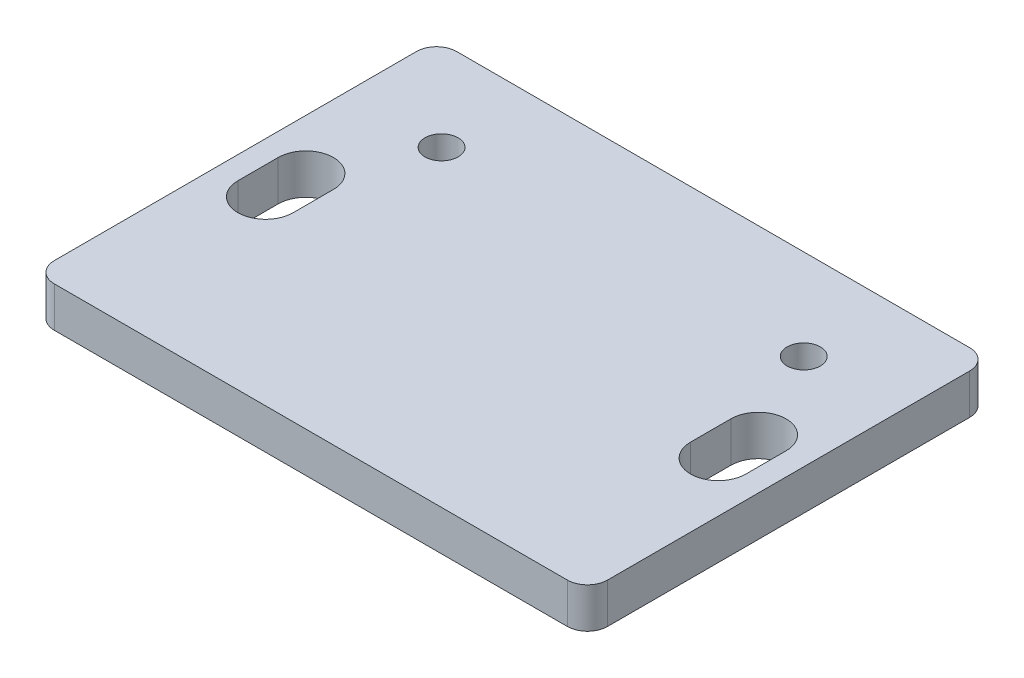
ISO-10303-21;
HEADER;
FILE_DESCRIPTION(('STEP AP214'),'2;1');
FILE_NAME('part.step','',(''),(''),'','','');
FILE_SCHEMA(('AUTOMOTIVE_DESIGN { 1 0 10303 214 1 1 1 1 }'));
ENDSEC;
DATA;
#1=APPLICATION_CONTEXT('core data for automotive mechanical design processes');
#2=APPLICATION_PROTOCOL_DEFINITION('international standard','automotive_design',2000,#1);
#3=PRODUCT_CONTEXT('',#1,'mechanical');
#4=PRODUCT('Part','Part','',(#3));
#5=PRODUCT_RELATED_PRODUCT_CATEGORY('part','',(#4));
#6=PRODUCT_DEFINITION_FORMATION('','',#4);
#7=PRODUCT_DEFINITION_CONTEXT('part definition',#1,'design');
#8=PRODUCT_DEFINITION('design','',#6,#7);
#9=PRODUCT_DEFINITION_SHAPE('','',#8);
#10=(LENGTH_UNIT() NAMED_UNIT(*) SI_UNIT(.MILLI.,.METRE.));
#11=(NAMED_UNIT(*) PLANE_ANGLE_UNIT() SI_UNIT($,.RADIAN.));
#12=(NAMED_UNIT(*) SI_UNIT($,.STERADIAN.) SOLID_ANGLE_UNIT());
#13=UNCERTAINTY_MEASURE_WITH_UNIT(LENGTH_MEASURE(1.E-05),#10,'distance_accuracy_value','');
#14=(GEOMETRIC_REPRESENTATION_CONTEXT(3) GLOBAL_UNCERTAINTY_ASSIGNED_CONTEXT((#13)) GLOBAL_UNIT_ASSIGNED_CONTEXT((#10,
#11,#12)) REPRESENTATION_CONTEXT('',''));
#15=CARTESIAN_POINT('',(0.,0.,0.));
#16=DIRECTION('',(0.,0.,1.));
#17=DIRECTION('',(1.,0.,0.));
#18=AXIS2_PLACEMENT_3D('',#15,#16,#17);
#19=CARTESIAN_POINT('',(27.5,4.,20.));
#20=DIRECTION('',(-1.,0.,0.));
#21=DIRECTION('',(0.,0.,1.));
#22=AXIS2_PLACEMENT_3D('',#19,#20,#21);
#23=PLANE('',#22);
#24=DIRECTION('',(0.,0.,-1.));
#25=VECTOR('',#24,1.);
#26=CARTESIAN_POINT('',(27.5,0.,20.));
#27=LINE('',#26,#25);
#28=CARTESIAN_POINT('',(27.5,0.,18.));
#29=VERTEX_POINT('',#28);
#30=CARTESIAN_POINT('',(27.5,0.,-18.));
#31=VERTEX_POINT('',#30);
#32=EDGE_CURVE('E238',#29,#31,#27,.T.);
#33=ORIENTED_EDGE('',*,*,#32,.T.);
#34=DIRECTION('',(0.,-1.,0.));
#35=VECTOR('',#34,1.);
#36=CARTESIAN_POINT('',(27.5,4.,-18.));
#37=LINE('',#36,#35);
#38=CARTESIAN_POINT('',(27.5,4.,-18.));
#39=VERTEX_POINT('',#38);
#40=EDGE_CURVE('E11',#31,#39,#37,.F.);
#41=ORIENTED_EDGE('',*,*,#40,.T.);
#42=DIRECTION('',(0.,0.,-1.));
#43=VECTOR('',#42,1.);
#44=CARTESIAN_POINT('',(27.5,4.,20.));
#45=LINE('',#44,#43);
#46=CARTESIAN_POINT('',(27.5,4.,18.));
#47=VERTEX_POINT('',#46);
#48=EDGE_CURVE('E239',#47,#39,#45,.T.);
#49=ORIENTED_EDGE('',*,*,#48,.F.);
#50=DIRECTION('',(0.,-1.,0.));
#51=VECTOR('',#50,1.);
#52=CARTESIAN_POINT('',(27.5,4.,18.));
#53=LINE('',#52,#51);
#54=EDGE_CURVE('E45',#47,#29,#53,.T.);
#55=ORIENTED_EDGE('',*,*,#54,.T.);
#56=EDGE_LOOP('',(#33,#41,#49,#55));
#57=FACE_BOUND('',#56,.T.);
#58=ADVANCED_FACE('F37',(#57),#23,.F.);
#59=CARTESIAN_POINT('',(-27.5,4.,-20.));
#60=DIRECTION('',(0.,0.,1.));
#61=DIRECTION('',(1.,0.,0.));
#62=AXIS2_PLACEMENT_3D('',#59,#60,#61);
#63=PLANE('',#62);
#64=DIRECTION('',(-1.,0.,0.));
#65=VECTOR('',#64,1.);
#66=CARTESIAN_POINT('',(-27.5,0.,-20.));
#67=LINE('',#66,#65);
#68=CARTESIAN_POINT('',(25.5,0.,-20.));
#69=VERTEX_POINT('',#68);
#70=CARTESIAN_POINT('',(-25.5,0.,-20.));
#71=VERTEX_POINT('',#70);
#72=EDGE_CURVE('E253',#69,#71,#67,.T.);
#73=ORIENTED_EDGE('',*,*,#72,.T.);
#74=DIRECTION('',(0.,-1.,0.));
#75=VECTOR('',#74,1.);
#76=CARTESIAN_POINT('',(-25.5,4.,-20.));
#77=LINE('',#76,#75);
#78=CARTESIAN_POINT('',(-25.5,4.,-20.));
#79=VERTEX_POINT('',#78);
#80=EDGE_CURVE('E52',#71,#79,#77,.F.);
#81=ORIENTED_EDGE('',*,*,#80,.T.);
#82=DIRECTION('',(-1.,0.,0.));
#83=VECTOR('',#82,1.);
#84=CARTESIAN_POINT('',(-27.5,4.,-20.));
#85=LINE('',#84,#83);
#86=CARTESIAN_POINT('',(25.5,4.,-20.));
#87=VERTEX_POINT('',#86);
#88=EDGE_CURVE('E241',#87,#79,#85,.T.);
#89=ORIENTED_EDGE('',*,*,#88,.F.);
#90=DIRECTION('',(0.,-1.,0.));
#91=VECTOR('',#90,1.);
#92=CARTESIAN_POINT('',(25.5,4.,-20.));
#93=LINE('',#92,#91);
#94=EDGE_CURVE('E284',#87,#69,#93,.T.);
#95=ORIENTED_EDGE('',*,*,#94,.T.);
#96=EDGE_LOOP('',(#73,#81,#89,#95));
#97=FACE_BOUND('',#96,.T.);
#98=ADVANCED_FACE('F301',(#97),#63,.F.);
#99=CARTESIAN_POINT('',(-27.5,4.,20.));
#100=DIRECTION('',(1.,0.,0.));
#101=DIRECTION('',(0.,0.,-1.));
#102=AXIS2_PLACEMENT_3D('',#99,#100,#101);
#103=PLANE('',#102);
#104=DIRECTION('',(0.,0.,1.));
#105=VECTOR('',#104,1.);
#106=CARTESIAN_POINT('',(-27.5,0.,20.));
#107=LINE('',#106,#105);
#108=CARTESIAN_POINT('',(-27.5,0.,-18.));
#109=VERTEX_POINT('',#108);
#110=CARTESIAN_POINT('',(-27.5,0.,18.));
#111=VERTEX_POINT('',#110);
#112=EDGE_CURVE('E255',#109,#111,#107,.T.);
#113=ORIENTED_EDGE('',*,*,#112,.T.);
#114=DIRECTION('',(0.,-1.,0.));
#115=VECTOR('',#114,1.);
#116=CARTESIAN_POINT('',(-27.5,4.,18.));
#117=LINE('',#116,#115);
#118=CARTESIAN_POINT('',(-27.5,4.,18.));
#119=VERTEX_POINT('',#118);
#120=EDGE_CURVE('E275',#111,#119,#117,.F.);
#121=ORIENTED_EDGE('',*,*,#120,.T.);
#122=DIRECTION('',(0.,0.,1.));
#123=VECTOR('',#122,1.);
#124=CARTESIAN_POINT('',(-27.5,4.,20.));
#125=LINE('',#124,#123);
#126=CARTESIAN_POINT('',(-27.5,4.,-18.));
#127=VERTEX_POINT('',#126);
#128=EDGE_CURVE('E244',#127,#119,#125,.T.);
#129=ORIENTED_EDGE('',*,*,#128,.F.);
#130=DIRECTION('',(0.,-1.,0.));
#131=VECTOR('',#130,1.);
#132=CARTESIAN_POINT('',(-27.5,4.,-18.));
#133=LINE('',#132,#131);
#134=EDGE_CURVE('E272',#127,#109,#133,.T.);
#135=ORIENTED_EDGE('',*,*,#134,.T.);
#136=EDGE_LOOP('',(#113,#121,#129,#135));
#137=FACE_BOUND('',#136,.T.);
#138=ADVANCED_FACE('F310',(#137),#103,.F.);
#139=CARTESIAN_POINT('',(-27.5,4.,20.));
#140=DIRECTION('',(0.,0.,-1.));
#141=DIRECTION('',(-1.,0.,0.));
#142=AXIS2_PLACEMENT_3D('',#139,#140,#141);
#143=PLANE('',#142);
#144=DIRECTION('',(1.,0.,0.));
#145=VECTOR('',#144,1.);
#146=CARTESIAN_POINT('',(-27.5,4.,20.));
#147=LINE('',#146,#145);
#148=CARTESIAN_POINT('',(-25.5,4.,20.));
#149=VERTEX_POINT('',#148);
#150=CARTESIAN_POINT('',(25.5,4.,20.));
#151=VERTEX_POINT('',#150);
#152=EDGE_CURVE('E247',#149,#151,#147,.T.);
#153=ORIENTED_EDGE('',*,*,#152,.F.);
#154=DIRECTION('',(0.,-1.,0.));
#155=VECTOR('',#154,1.);
#156=CARTESIAN_POINT('',(-25.5,4.,20.));
#157=LINE('',#156,#155);
#158=CARTESIAN_POINT('',(-25.5,0.,20.));
#159=VERTEX_POINT('',#158);
#160=EDGE_CURVE('E261',#149,#159,#157,.T.);
#161=ORIENTED_EDGE('',*,*,#160,.T.);
#162=DIRECTION('',(1.,0.,0.));
#163=VECTOR('',#162,1.);
#164=CARTESIAN_POINT('',(-27.5,0.,20.));
#165=LINE('',#164,#163);
#166=CARTESIAN_POINT('',(25.5,0.,20.));
#167=VERTEX_POINT('',#166);
#168=EDGE_CURVE('E242',#159,#167,#165,.T.);
#169=ORIENTED_EDGE('',*,*,#168,.T.);
#170=DIRECTION('',(0.,-1.,0.));
#171=VECTOR('',#170,1.);
#172=CARTESIAN_POINT('',(25.5,4.,20.));
#173=LINE('',#172,#171);
#174=EDGE_CURVE('E250',#167,#151,#173,.F.);
#175=ORIENTED_EDGE('',*,*,#174,.T.);
#176=EDGE_LOOP('',(#153,#161,#169,#175));
#177=FACE_BOUND('',#176,.T.);
#178=ADVANCED_FACE('F318',(#177),#143,.F.);
#179=CARTESIAN_POINT('',(0.,4.,0.));
#180=DIRECTION('',(0.,-1.,0.));
#181=DIRECTION('',(0.,0.,-1.));
#182=AXIS2_PLACEMENT_3D('',#179,#180,#181);
#183=PLANE('',#182);
#184=DIRECTION('',(0.,0.,-1.));
#185=VECTOR('',#184,1.);
#186=CARTESIAN_POINT('',(25.25,4.,2.));
#187=LINE('',#186,#185);
#188=CARTESIAN_POINT('',(25.25,4.,2.));
#189=VERTEX_POINT('',#188);
#190=CARTESIAN_POINT('',(25.25,4.,-2.));
#191=VERTEX_POINT('',#190);
#192=EDGE_CURVE('E185',#189,#191,#187,.T.);
#193=ORIENTED_EDGE('',*,*,#192,.F.);
#194=CARTESIAN_POINT('',(22.5,4.,2.));
#195=DIRECTION('',(0.,1.,0.));
#196=DIRECTION('',(0.,0.,1.));
#197=AXIS2_PLACEMENT_3D('',#194,#195,#196);
#198=CIRCLE('',#197,2.75);
#199=CARTESIAN_POINT('',(19.75,4.,2.));
#200=VERTEX_POINT('',#199);
#201=EDGE_CURVE('E158',#200,#189,#198,.T.);
#202=ORIENTED_EDGE('',*,*,#201,.F.);
#203=DIRECTION('',(0.,0.,1.));
#204=VECTOR('',#203,1.);
#205=CARTESIAN_POINT('',(19.75,4.,2.));
#206=LINE('',#205,#204);
#207=CARTESIAN_POINT('',(19.75,4.,-2.));
#208=VERTEX_POINT('',#207);
#209=EDGE_CURVE('E176',#208,#200,#206,.T.);
#210=ORIENTED_EDGE('',*,*,#209,.F.);
#211=CARTESIAN_POINT('',(22.5,4.,-2.));
#212=DIRECTION('',(0.,1.,0.));
#213=DIRECTION('',(0.,0.,1.));
#214=AXIS2_PLACEMENT_3D('',#211,#212,#213);
#215=CIRCLE('',#214,2.75);
#216=EDGE_CURVE('E179',#191,#208,#215,.T.);
#217=ORIENTED_EDGE('',*,*,#216,.F.);
#218=EDGE_LOOP('',(#193,#202,#210,#217));
#219=FACE_BOUND('',#218,.T.);
#220=DIRECTION('',(0.,0.,-1.));
#221=VECTOR('',#220,1.);
#222=CARTESIAN_POINT('',(-19.75,4.,2.00000000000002));
#223=LINE('',#222,#221);
#224=CARTESIAN_POINT('',(-19.75,4.,2.00000000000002));
#225=VERTEX_POINT('',#224);
#226=CARTESIAN_POINT('',(-19.75,4.,-1.99999999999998));
#227=VERTEX_POINT('',#226);
#228=EDGE_CURVE('E210',#225,#227,#223,.T.);
#229=ORIENTED_EDGE('',*,*,#228,.F.);
#230=CARTESIAN_POINT('',(-22.5,4.,2.00000000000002));
#231=DIRECTION('',(0.,1.,0.));
#232=DIRECTION('',(0.,0.,1.));
#233=AXIS2_PLACEMENT_3D('',#230,#231,#232);
#234=CIRCLE('',#233,2.75);
#235=CARTESIAN_POINT('',(-25.25,4.,2.00000000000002));
#236=VERTEX_POINT('',#235);
#237=EDGE_CURVE('E191',#236,#225,#234,.T.);
#238=ORIENTED_EDGE('',*,*,#237,.F.);
#239=DIRECTION('',(0.,0.,1.));
#240=VECTOR('',#239,1.);
#241=CARTESIAN_POINT('',(-25.25,4.,2.00000000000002));
#242=LINE('',#241,#240);
#243=CARTESIAN_POINT('',(-25.25,4.,-1.99999999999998));
#244=VERTEX_POINT('',#243);
#245=EDGE_CURVE('E199',#244,#236,#242,.T.);
#246=ORIENTED_EDGE('',*,*,#245,.F.);
#247=CARTESIAN_POINT('',(-22.5,4.,-1.99999999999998));
#248=DIRECTION('',(0.,1.,0.));
#249=DIRECTION('',(0.,0.,1.));
#250=AXIS2_PLACEMENT_3D('',#247,#248,#249);
#251=CIRCLE('',#250,2.75);
#252=EDGE_CURVE('E213',#227,#244,#251,.T.);
#253=ORIENTED_EDGE('',*,*,#252,.F.);
#254=EDGE_LOOP('',(#229,#238,#246,#253));
#255=FACE_BOUND('',#254,.T.);
#256=CARTESIAN_POINT('',(-18.,4.,-11.));
#257=DIRECTION('',(0.,1.,0.));
#258=DIRECTION('',(0.,0.,1.));
#259=AXIS2_PLACEMENT_3D('',#256,#257,#258);
#260=CIRCLE('',#259,1.65);
#261=CARTESIAN_POINT('',(-18.,4.,-9.35));
#262=VERTEX_POINT('',#261);
#263=EDGE_CURVE('E220',#262,#262,#260,.T.);
#264=ORIENTED_EDGE('',*,*,#263,.F.);
#265=EDGE_LOOP('',(#264));
#266=FACE_BOUND('',#265,.T.);
#267=CARTESIAN_POINT('',(18.,4.,-11.));
#268=DIRECTION('',(0.,1.,0.));
#269=DIRECTION('',(0.,0.,1.));
#270=AXIS2_PLACEMENT_3D('',#267,#268,#269);
#271=CIRCLE('',#270,1.65);
#272=CARTESIAN_POINT('',(18.,4.,-9.35));
#273=VERTEX_POINT('',#272);
#274=EDGE_CURVE('E232',#273,#273,#271,.T.);
#275=ORIENTED_EDGE('',*,*,#274,.F.);
#276=EDGE_LOOP('',(#275));
#277=FACE_BOUND('',#276,.T.);
#278=ORIENTED_EDGE('',*,*,#128,.T.);
#279=CARTESIAN_POINT('',(-25.5,4.,18.));
#280=DIRECTION('',(0.,-1.,0.));
#281=DIRECTION('',(0.,0.,-1.));
#282=AXIS2_PLACEMENT_3D('',#279,#280,#281);
#283=CIRCLE('',#282,2.);
#284=EDGE_CURVE('E282',#119,#149,#283,.F.);
#285=ORIENTED_EDGE('',*,*,#284,.T.);
#286=ORIENTED_EDGE('',*,*,#152,.T.);
#287=CARTESIAN_POINT('',(25.5,4.,18.));
#288=DIRECTION('',(0.,-1.,0.));
#289=DIRECTION('',(0.,0.,-1.));
#290=AXIS2_PLACEMENT_3D('',#287,#288,#289);
#291=CIRCLE('',#290,2.);
#292=EDGE_CURVE('E277',#151,#47,#291,.F.);
#293=ORIENTED_EDGE('',*,*,#292,.T.);
#294=ORIENTED_EDGE('',*,*,#48,.T.);
#295=CARTESIAN_POINT('',(25.5,4.,-18.));
#296=DIRECTION('',(0.,-1.,0.));
#297=DIRECTION('',(0.,0.,-1.));
#298=AXIS2_PLACEMENT_3D('',#295,#296,#297);
#299=CIRCLE('',#298,2.);
#300=EDGE_CURVE('E59',#39,#87,#299,.F.);
#301=ORIENTED_EDGE('',*,*,#300,.T.);
#302=ORIENTED_EDGE('',*,*,#88,.T.);
#303=CARTESIAN_POINT('',(-25.5,4.,-18.));
#304=DIRECTION('',(0.,-1.,0.));
#305=DIRECTION('',(0.,0.,-1.));
#306=AXIS2_PLACEMENT_3D('',#303,#304,#305);
#307=CIRCLE('',#306,2.);
#308=EDGE_CURVE('E280',#79,#127,#307,.F.);
#309=ORIENTED_EDGE('',*,*,#308,.T.);
#310=EDGE_LOOP('',(#278,#285,#286,#293,#294,#301,#302,#309));
#311=FACE_BOUND('',#310,.T.);
#312=ADVANCED_FACE('F303',(#219,#255,#266,#277,#311),#183,.F.);
#313=CARTESIAN_POINT('',(0.,0.,0.));
#314=DIRECTION('',(0.,-1.,0.));
#315=DIRECTION('',(0.,0.,-1.));
#316=AXIS2_PLACEMENT_3D('',#313,#314,#315);
#317=PLANE('',#316);
#318=CARTESIAN_POINT('',(22.5,0.,2.));
#319=DIRECTION('',(0.,1.,0.));
#320=DIRECTION('',(0.,0.,1.));
#321=AXIS2_PLACEMENT_3D('',#318,#319,#320);
#322=CIRCLE('',#321,2.75);
#323=CARTESIAN_POINT('',(19.75,0.,2.));
#324=VERTEX_POINT('',#323);
#325=CARTESIAN_POINT('',(25.25,0.,2.));
#326=VERTEX_POINT('',#325);
#327=EDGE_CURVE('E155',#324,#326,#322,.T.);
#328=ORIENTED_EDGE('',*,*,#327,.T.);
#329=DIRECTION('',(0.,0.,-1.));
#330=VECTOR('',#329,1.);
#331=CARTESIAN_POINT('',(25.25,0.,2.));
#332=LINE('',#331,#330);
#333=CARTESIAN_POINT('',(25.25,0.,-2.));
#334=VERTEX_POINT('',#333);
#335=EDGE_CURVE('E167',#326,#334,#332,.T.);
#336=ORIENTED_EDGE('',*,*,#335,.T.);
#337=CARTESIAN_POINT('',(22.5,0.,-2.));
#338=DIRECTION('',(0.,1.,0.));
#339=DIRECTION('',(0.,0.,1.));
#340=AXIS2_PLACEMENT_3D('',#337,#338,#339);
#341=CIRCLE('',#340,2.75);
#342=CARTESIAN_POINT('',(19.75,0.,-2.));
#343=VERTEX_POINT('',#342);
#344=EDGE_CURVE('E171',#334,#343,#341,.T.);
#345=ORIENTED_EDGE('',*,*,#344,.T.);
#346=DIRECTION('',(0.,0.,1.));
#347=VECTOR('',#346,1.);
#348=CARTESIAN_POINT('',(19.75,0.,2.));
#349=LINE('',#348,#347);
#350=EDGE_CURVE('E163',#343,#324,#349,.T.);
#351=ORIENTED_EDGE('',*,*,#350,.T.);
#352=EDGE_LOOP('',(#328,#336,#345,#351));
#353=FACE_BOUND('',#352,.T.);
#354=CARTESIAN_POINT('',(-22.5,0.,2.00000000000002));
#355=DIRECTION('',(0.,1.,0.));
#356=DIRECTION('',(0.,0.,1.));
#357=AXIS2_PLACEMENT_3D('',#354,#355,#356);
#358=CIRCLE('',#357,2.75);
#359=CARTESIAN_POINT('',(-25.25,0.,2.00000000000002));
#360=VERTEX_POINT('',#359);
#361=CARTESIAN_POINT('',(-19.75,0.,2.00000000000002));
#362=VERTEX_POINT('',#361);
#363=EDGE_CURVE('E195',#360,#362,#358,.T.);
#364=ORIENTED_EDGE('',*,*,#363,.T.);
#365=DIRECTION('',(0.,0.,-1.));
#366=VECTOR('',#365,1.);
#367=CARTESIAN_POINT('',(-19.75,0.,2.00000000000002));
#368=LINE('',#367,#366);
#369=CARTESIAN_POINT('',(-19.75,0.,-1.99999999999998));
#370=VERTEX_POINT('',#369);
#371=EDGE_CURVE('E198',#362,#370,#368,.T.);
#372=ORIENTED_EDGE('',*,*,#371,.T.);
#373=CARTESIAN_POINT('',(-22.5,0.,-1.99999999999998));
#374=DIRECTION('',(0.,1.,0.));
#375=DIRECTION('',(0.,0.,1.));
#376=AXIS2_PLACEMENT_3D('',#373,#374,#375);
#377=CIRCLE('',#376,2.75);
#378=CARTESIAN_POINT('',(-25.25,0.,-1.99999999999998));
#379=VERTEX_POINT('',#378);
#380=EDGE_CURVE('E202',#370,#379,#377,.T.);
#381=ORIENTED_EDGE('',*,*,#380,.T.);
#382=DIRECTION('',(0.,0.,1.));
#383=VECTOR('',#382,1.);
#384=CARTESIAN_POINT('',(-25.25,0.,2.00000000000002));
#385=LINE('',#384,#383);
#386=EDGE_CURVE('E205',#379,#360,#385,.T.);
#387=ORIENTED_EDGE('',*,*,#386,.T.);
#388=EDGE_LOOP('',(#364,#372,#381,#387));
#389=FACE_BOUND('',#388,.T.);
#390=CARTESIAN_POINT('',(-18.,0.,-11.));
#391=DIRECTION('',(0.,1.,0.));
#392=DIRECTION('',(0.,0.,1.));
#393=AXIS2_PLACEMENT_3D('',#390,#391,#392);
#394=CIRCLE('',#393,1.65);
#395=CARTESIAN_POINT('',(-18.,0.,-9.35));
#396=VERTEX_POINT('',#395);
#397=EDGE_CURVE('E229',#396,#396,#394,.T.);
#398=ORIENTED_EDGE('',*,*,#397,.T.);
#399=EDGE_LOOP('',(#398));
#400=FACE_BOUND('',#399,.T.);
#401=CARTESIAN_POINT('',(18.,0.,-11.));
#402=DIRECTION('',(0.,1.,0.));
#403=DIRECTION('',(0.,0.,1.));
#404=AXIS2_PLACEMENT_3D('',#401,#402,#403);
#405=CIRCLE('',#404,1.65);
#406=CARTESIAN_POINT('',(18.,0.,-9.35));
#407=VERTEX_POINT('',#406);
#408=EDGE_CURVE('E235',#407,#407,#405,.T.);
#409=ORIENTED_EDGE('',*,*,#408,.T.);
#410=EDGE_LOOP('',(#409));
#411=FACE_BOUND('',#410,.T.);
#412=ORIENTED_EDGE('',*,*,#168,.F.);
#413=CARTESIAN_POINT('',(-25.5,0.,18.));
#414=DIRECTION('',(0.,-1.,0.));
#415=DIRECTION('',(0.,0.,-1.));
#416=AXIS2_PLACEMENT_3D('',#413,#414,#415);
#417=CIRCLE('',#416,2.);
#418=EDGE_CURVE('E270',#159,#111,#417,.T.);
#419=ORIENTED_EDGE('',*,*,#418,.T.);
#420=ORIENTED_EDGE('',*,*,#112,.F.);
#421=CARTESIAN_POINT('',(-25.5,0.,-18.));
#422=DIRECTION('',(0.,-1.,0.));
#423=DIRECTION('',(0.,0.,-1.));
#424=AXIS2_PLACEMENT_3D('',#421,#422,#423);
#425=CIRCLE('',#424,2.);
#426=EDGE_CURVE('E268',#109,#71,#425,.T.);
#427=ORIENTED_EDGE('',*,*,#426,.T.);
#428=ORIENTED_EDGE('',*,*,#72,.F.);
#429=CARTESIAN_POINT('',(25.5,0.,-18.));
#430=DIRECTION('',(0.,-1.,0.));
#431=DIRECTION('',(0.,0.,-1.));
#432=AXIS2_PLACEMENT_3D('',#429,#430,#431);
#433=CIRCLE('',#432,2.);
#434=EDGE_CURVE('E266',#69,#31,#433,.T.);
#435=ORIENTED_EDGE('',*,*,#434,.T.);
#436=ORIENTED_EDGE('',*,*,#32,.F.);
#437=CARTESIAN_POINT('',(25.5,0.,18.));
#438=DIRECTION('',(0.,-1.,0.));
#439=DIRECTION('',(0.,0.,-1.));
#440=AXIS2_PLACEMENT_3D('',#437,#438,#439);
#441=CIRCLE('',#440,2.);
#442=EDGE_CURVE('E264',#29,#167,#441,.T.);
#443=ORIENTED_EDGE('',*,*,#442,.T.);
#444=EDGE_LOOP('',(#412,#419,#420,#427,#428,#435,#436,#443));
#445=FACE_BOUND('',#444,.T.);
#446=ADVANCED_FACE('F173',(#353,#389,#400,#411,#445),#317,.T.);
#447=CARTESIAN_POINT('',(18.,4.,-11.));
#448=DIRECTION('',(0.,1.,0.));
#449=DIRECTION('',(0.,0.,1.));
#450=AXIS2_PLACEMENT_3D('',#447,#448,#449);
#451=CYLINDRICAL_SURFACE('',#450,1.65);
#452=ORIENTED_EDGE('',*,*,#408,.F.);
#453=EDGE_LOOP('',(#452));
#454=FACE_BOUND('',#453,.T.);
#455=ORIENTED_EDGE('',*,*,#274,.T.);
#456=EDGE_LOOP('',(#455));
#457=FACE_BOUND('',#456,.T.);
#458=ADVANCED_FACE('F433',(#454,#457),#451,.F.);
#459=CARTESIAN_POINT('',(-18.,4.,-11.));
#460=DIRECTION('',(0.,1.,0.));
#461=DIRECTION('',(0.,0.,1.));
#462=AXIS2_PLACEMENT_3D('',#459,#460,#461);
#463=CYLINDRICAL_SURFACE('',#462,1.65);
#464=ORIENTED_EDGE('',*,*,#397,.F.);
#465=EDGE_LOOP('',(#464));
#466=FACE_BOUND('',#465,.T.);
#467=ORIENTED_EDGE('',*,*,#263,.T.);
#468=EDGE_LOOP('',(#467));
#469=FACE_BOUND('',#468,.T.);
#470=ADVANCED_FACE('F424',(#466,#469),#463,.F.);
#471=CARTESIAN_POINT('',(-22.5,0.,2.00000000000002));
#472=DIRECTION('',(0.,1.,0.));
#473=DIRECTION('',(0.,0.,1.));
#474=AXIS2_PLACEMENT_3D('',#471,#472,#473);
#475=CYLINDRICAL_SURFACE('',#474,2.75);
#476=ORIENTED_EDGE('',*,*,#237,.T.);
#477=DIRECTION('',(0.,1.,0.));
#478=VECTOR('',#477,1.);
#479=CARTESIAN_POINT('',(-19.75,0.,2.00000000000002));
#480=LINE('',#479,#478);
#481=EDGE_CURVE('E208',#362,#225,#480,.T.);
#482=ORIENTED_EDGE('',*,*,#481,.F.);
#483=ORIENTED_EDGE('',*,*,#363,.F.);
#484=DIRECTION('',(0.,1.,0.));
#485=VECTOR('',#484,1.);
#486=CARTESIAN_POINT('',(-25.25,0.,2.00000000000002));
#487=LINE('',#486,#485);
#488=EDGE_CURVE('E218',#360,#236,#487,.T.);
#489=ORIENTED_EDGE('',*,*,#488,.T.);
#490=EDGE_LOOP('',(#476,#482,#483,#489));
#491=FACE_BOUND('',#490,.T.);
#492=ADVANCED_FACE('F415',(#491),#475,.F.);
#493=CARTESIAN_POINT('',(-25.25,0.,2.00000000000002));
#494=DIRECTION('',(-1.,0.,0.));
#495=DIRECTION('',(0.,0.,1.));
#496=AXIS2_PLACEMENT_3D('',#493,#494,#495);
#497=PLANE('',#496);
#498=ORIENTED_EDGE('',*,*,#245,.T.);
#499=ORIENTED_EDGE('',*,*,#488,.F.);
#500=ORIENTED_EDGE('',*,*,#386,.F.);
#501=DIRECTION('',(0.,1.,0.));
#502=VECTOR('',#501,1.);
#503=CARTESIAN_POINT('',(-25.25,0.,-1.99999999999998));
#504=LINE('',#503,#502);
#505=EDGE_CURVE('E221',#379,#244,#504,.T.);
#506=ORIENTED_EDGE('',*,*,#505,.T.);
#507=EDGE_LOOP('',(#498,#499,#500,#506));
#508=FACE_BOUND('',#507,.T.);
#509=ADVANCED_FACE('F406',(#508),#497,.F.);
#510=CARTESIAN_POINT('',(-22.5,0.,-1.99999999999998));
#511=DIRECTION('',(0.,1.,0.));
#512=DIRECTION('',(0.,0.,1.));
#513=AXIS2_PLACEMENT_3D('',#510,#511,#512);
#514=CYLINDRICAL_SURFACE('',#513,2.75);
#515=ORIENTED_EDGE('',*,*,#252,.T.);
#516=ORIENTED_EDGE('',*,*,#505,.F.);
#517=ORIENTED_EDGE('',*,*,#380,.F.);
#518=DIRECTION('',(0.,1.,0.));
#519=VECTOR('',#518,1.);
#520=CARTESIAN_POINT('',(-19.75,0.,-1.99999999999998));
#521=LINE('',#520,#519);
#522=EDGE_CURVE('E223',#370,#227,#521,.T.);
#523=ORIENTED_EDGE('',*,*,#522,.T.);
#524=EDGE_LOOP('',(#515,#516,#517,#523));
#525=FACE_BOUND('',#524,.T.);
#526=ADVANCED_FACE('F397',(#525),#514,.F.);
#527=CARTESIAN_POINT('',(-19.75,0.,2.00000000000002));
#528=DIRECTION('',(1.,0.,0.));
#529=DIRECTION('',(0.,0.,-1.));
#530=AXIS2_PLACEMENT_3D('',#527,#528,#529);
#531=PLANE('',#530);
#532=ORIENTED_EDGE('',*,*,#228,.T.);
#533=ORIENTED_EDGE('',*,*,#522,.F.);
#534=ORIENTED_EDGE('',*,*,#371,.F.);
#535=ORIENTED_EDGE('',*,*,#481,.T.);
#536=EDGE_LOOP('',(#532,#533,#534,#535));
#537=FACE_BOUND('',#536,.T.);
#538=ADVANCED_FACE('F389',(#537),#531,.F.);
#539=CARTESIAN_POINT('',(22.5,0.,2.));
#540=DIRECTION('',(0.,1.,0.));
#541=DIRECTION('',(0.,0.,1.));
#542=AXIS2_PLACEMENT_3D('',#539,#540,#541);
#543=CYLINDRICAL_SURFACE('',#542,2.75);
#544=ORIENTED_EDGE('',*,*,#201,.T.);
#545=DIRECTION('',(0.,1.,0.));
#546=VECTOR('',#545,1.);
#547=CARTESIAN_POINT('',(25.25,0.,2.));
#548=LINE('',#547,#546);
#549=EDGE_CURVE('E151',#326,#189,#548,.T.);
#550=ORIENTED_EDGE('',*,*,#549,.F.);
#551=ORIENTED_EDGE('',*,*,#327,.F.);
#552=DIRECTION('',(0.,1.,0.));
#553=VECTOR('',#552,1.);
#554=CARTESIAN_POINT('',(19.75,0.,2.));
#555=LINE('',#554,#553);
#556=EDGE_CURVE('E189',#324,#200,#555,.T.);
#557=ORIENTED_EDGE('',*,*,#556,.T.);
#558=EDGE_LOOP('',(#544,#550,#551,#557));
#559=FACE_BOUND('',#558,.T.);
#560=ADVANCED_FACE('F153',(#559),#543,.F.);
#561=CARTESIAN_POINT('',(19.75,0.,2.));
#562=DIRECTION('',(-1.,0.,0.));
#563=DIRECTION('',(0.,0.,1.));
#564=AXIS2_PLACEMENT_3D('',#561,#562,#563);
#565=PLANE('',#564);
#566=ORIENTED_EDGE('',*,*,#209,.T.);
#567=ORIENTED_EDGE('',*,*,#556,.F.);
#568=ORIENTED_EDGE('',*,*,#350,.F.);
#569=DIRECTION('',(0.,1.,0.));
#570=VECTOR('',#569,1.);
#571=CARTESIAN_POINT('',(19.75,0.,-2.));
#572=LINE('',#571,#570);
#573=EDGE_CURVE('E192',#343,#208,#572,.T.);
#574=ORIENTED_EDGE('',*,*,#573,.T.);
#575=EDGE_LOOP('',(#566,#567,#568,#574));
#576=FACE_BOUND('',#575,.T.);
#577=ADVANCED_FACE('F372',(#576),#565,.F.);
#578=CARTESIAN_POINT('',(22.5,0.,-2.));
#579=DIRECTION('',(0.,1.,0.));
#580=DIRECTION('',(0.,0.,1.));
#581=AXIS2_PLACEMENT_3D('',#578,#579,#580);
#582=CYLINDRICAL_SURFACE('',#581,2.75);
#583=ORIENTED_EDGE('',*,*,#216,.T.);
#584=ORIENTED_EDGE('',*,*,#573,.F.);
#585=ORIENTED_EDGE('',*,*,#344,.F.);
#586=DIRECTION('',(0.,1.,0.));
#587=VECTOR('',#586,1.);
#588=CARTESIAN_POINT('',(25.25,0.,-2.));
#589=LINE('',#588,#587);
#590=EDGE_CURVE('E162',#334,#191,#589,.T.);
#591=ORIENTED_EDGE('',*,*,#590,.T.);
#592=EDGE_LOOP('',(#583,#584,#585,#591));
#593=FACE_BOUND('',#592,.T.);
#594=ADVANCED_FACE('F364',(#593),#582,.F.);
#595=CARTESIAN_POINT('',(25.25,0.,2.));
#596=DIRECTION('',(1.,0.,0.));
#597=DIRECTION('',(0.,0.,-1.));
#598=AXIS2_PLACEMENT_3D('',#595,#596,#597);
#599=PLANE('',#598);
#600=ORIENTED_EDGE('',*,*,#192,.T.);
#601=ORIENTED_EDGE('',*,*,#590,.F.);
#602=ORIENTED_EDGE('',*,*,#335,.F.);
#603=ORIENTED_EDGE('',*,*,#549,.T.);
#604=EDGE_LOOP('',(#600,#601,#602,#603));
#605=FACE_BOUND('',#604,.T.);
#606=ADVANCED_FACE('F168',(#605),#599,.F.);
#607=CARTESIAN_POINT('',(-25.5,4.,18.));
#608=DIRECTION('',(0.,-1.,0.));
#609=DIRECTION('',(0.,0.,-1.));
#610=AXIS2_PLACEMENT_3D('',#607,#608,#609);
#611=CYLINDRICAL_SURFACE('',#610,2.);
#612=ORIENTED_EDGE('',*,*,#284,.F.);
#613=ORIENTED_EDGE('',*,*,#120,.F.);
#614=ORIENTED_EDGE('',*,*,#418,.F.);
#615=ORIENTED_EDGE('',*,*,#160,.F.);
#616=EDGE_LOOP('',(#612,#613,#614,#615));
#617=FACE_BOUND('',#616,.T.);
#618=ADVANCED_FACE('F315',(#617),#611,.T.);
#619=CARTESIAN_POINT('',(-25.5,4.,-18.));
#620=DIRECTION('',(0.,-1.,0.));
#621=DIRECTION('',(0.,0.,-1.));
#622=AXIS2_PLACEMENT_3D('',#619,#620,#621);
#623=CYLINDRICAL_SURFACE('',#622,2.);
#624=ORIENTED_EDGE('',*,*,#308,.F.);
#625=ORIENTED_EDGE('',*,*,#80,.F.);
#626=ORIENTED_EDGE('',*,*,#426,.F.);
#627=ORIENTED_EDGE('',*,*,#134,.F.);
#628=EDGE_LOOP('',(#624,#625,#626,#627));
#629=FACE_BOUND('',#628,.T.);
#630=ADVANCED_FACE('F307',(#629),#623,.T.);
#631=CARTESIAN_POINT('',(25.5,4.,-18.));
#632=DIRECTION('',(0.,-1.,0.));
#633=DIRECTION('',(0.,0.,-1.));
#634=AXIS2_PLACEMENT_3D('',#631,#632,#633);
#635=CYLINDRICAL_SURFACE('',#634,2.);
#636=ORIENTED_EDGE('',*,*,#300,.F.);
#637=ORIENTED_EDGE('',*,*,#40,.F.);
#638=ORIENTED_EDGE('',*,*,#434,.F.);
#639=ORIENTED_EDGE('',*,*,#94,.F.);
#640=EDGE_LOOP('',(#636,#637,#638,#639));
#641=FACE_BOUND('',#640,.T.);
#642=ADVANCED_FACE('F300',(#641),#635,.T.);
#643=CARTESIAN_POINT('',(25.5,4.,18.));
#644=DIRECTION('',(0.,-1.,0.));
#645=DIRECTION('',(0.,0.,-1.));
#646=AXIS2_PLACEMENT_3D('',#643,#644,#645);
#647=CYLINDRICAL_SURFACE('',#646,2.);
#648=ORIENTED_EDGE('',*,*,#292,.F.);
#649=ORIENTED_EDGE('',*,*,#174,.F.);
#650=ORIENTED_EDGE('',*,*,#442,.F.);
#651=ORIENTED_EDGE('',*,*,#54,.F.);
#652=EDGE_LOOP('',(#648,#649,#650,#651));
#653=FACE_BOUND('',#652,.T.);
#654=ADVANCED_FACE('F39',(#653),#647,.T.);
#655=CLOSED_SHELL('',(#58,#98,#138,#178,#312,#446,#458,#470,#492,#509,#526,#538,#560,#577,#594,
#606,#618,#630,#642,#654));
#656=MANIFOLD_SOLID_BREP('B2',#655);
#657=ADVANCED_BREP_SHAPE_REPRESENTATION('',(#18,#656),#14);
#658=SHAPE_DEFINITION_REPRESENTATION(#9,#657);
ENDSEC;
END-ISO-10303-21;
